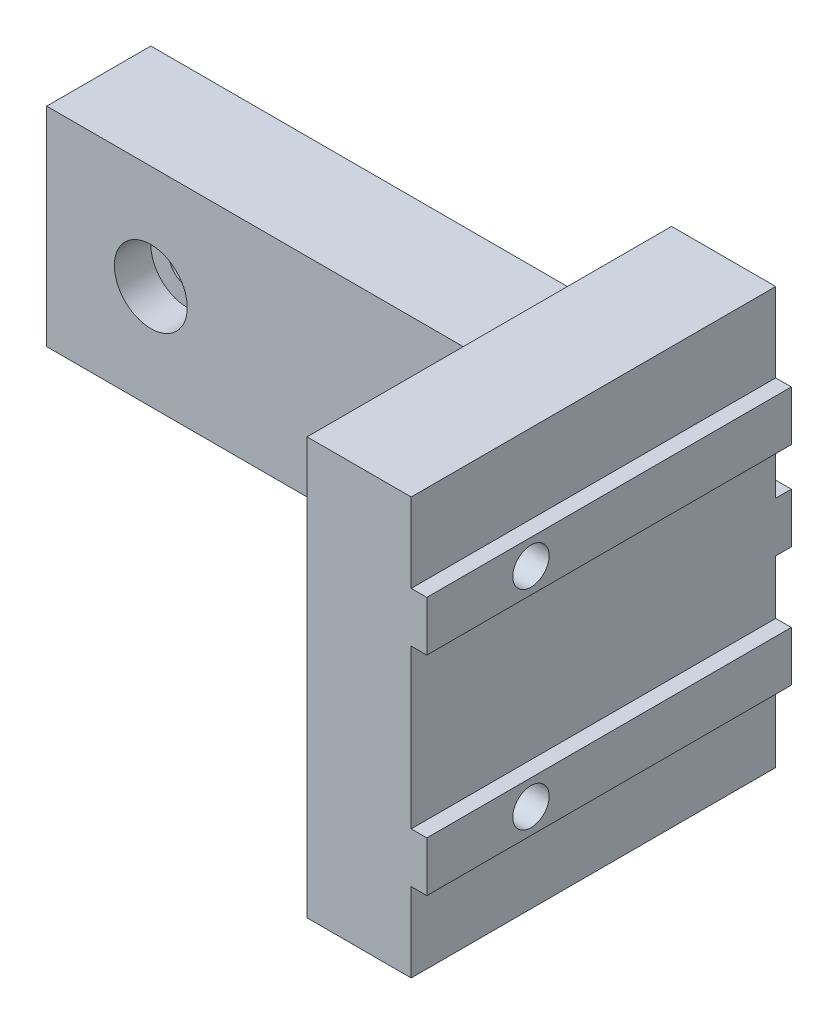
ISO-10303-21;
HEADER;
FILE_DESCRIPTION(('STEP AP214'),'2;1');
FILE_NAME('part.step','',(''),(''),'','','');
FILE_SCHEMA(('AUTOMOTIVE_DESIGN { 1 0 10303 214 1 1 1 1 }'));
ENDSEC;
DATA;
#1=APPLICATION_CONTEXT('core data for automotive mechanical design processes');
#2=APPLICATION_PROTOCOL_DEFINITION('international standard','automotive_design',2000,#1);
#3=PRODUCT_CONTEXT('',#1,'mechanical');
#4=PRODUCT('Part','Part','',(#3));
#5=PRODUCT_RELATED_PRODUCT_CATEGORY('part','',(#4));
#6=PRODUCT_DEFINITION_FORMATION('','',#4);
#7=PRODUCT_DEFINITION_CONTEXT('part definition',#1,'design');
#8=PRODUCT_DEFINITION('design','',#6,#7);
#9=PRODUCT_DEFINITION_SHAPE('','',#8);
#10=(LENGTH_UNIT() NAMED_UNIT(*) SI_UNIT(.MILLI.,.METRE.));
#11=(NAMED_UNIT(*) PLANE_ANGLE_UNIT() SI_UNIT($,.RADIAN.));
#12=(NAMED_UNIT(*) SI_UNIT($,.STERADIAN.) SOLID_ANGLE_UNIT());
#13=UNCERTAINTY_MEASURE_WITH_UNIT(LENGTH_MEASURE(1.E-05),#10,'distance_accuracy_value','');
#14=(GEOMETRIC_REPRESENTATION_CONTEXT(3) GLOBAL_UNCERTAINTY_ASSIGNED_CONTEXT((#13)) GLOBAL_UNIT_ASSIGNED_CONTEXT((#10,
#11,#12)) REPRESENTATION_CONTEXT('',''));
#15=CARTESIAN_POINT('',(0.,0.,0.));
#16=DIRECTION('',(0.,0.,1.));
#17=DIRECTION('',(1.,0.,0.));
#18=AXIS2_PLACEMENT_3D('',#15,#16,#17);
#19=CARTESIAN_POINT('',(0.,10.,0.));
#20=DIRECTION('',(-1.,0.,0.));
#21=DIRECTION('',(0.,0.,1.));
#22=AXIS2_PLACEMENT_3D('',#19,#20,#21);
#23=PLANE('',#22);
#24=DIRECTION('',(0.,0.,-1.));
#25=VECTOR('',#24,1.);
#26=CARTESIAN_POINT('',(0.,-12.4,35.));
#27=LINE('',#26,#25);
#28=CARTESIAN_POINT('',(0.,-12.4,35.));
#29=VERTEX_POINT('',#28);
#30=CARTESIAN_POINT('',(0.,-12.4,0.));
#31=VERTEX_POINT('',#30);
#32=EDGE_CURVE('E480',#29,#31,#27,.T.);
#33=ORIENTED_EDGE('',*,*,#32,.F.);
#34=DIRECTION('',(0.,-1.,0.));
#35=VECTOR('',#34,1.);
#36=CARTESIAN_POINT('',(0.,10.,35.));
#37=LINE('',#36,#35);
#38=CARTESIAN_POINT('',(0.,-20.,35.));
#39=VERTEX_POINT('',#38);
#40=EDGE_CURVE('E234',#29,#39,#37,.T.);
#41=ORIENTED_EDGE('',*,*,#40,.T.);
#42=DIRECTION('',(0.,0.,1.));
#43=VECTOR('',#42,1.);
#44=CARTESIAN_POINT('',(0.,-20.,-14.142135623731));
#45=LINE('',#44,#43);
#46=CARTESIAN_POINT('',(0.,-20.,0.));
#47=VERTEX_POINT('',#46);
#48=EDGE_CURVE('E283',#47,#39,#45,.T.);
#49=ORIENTED_EDGE('',*,*,#48,.F.);
#50=DIRECTION('',(0.,-1.,0.));
#51=VECTOR('',#50,1.);
#52=CARTESIAN_POINT('',(0.,10.,0.));
#53=LINE('',#52,#51);
#54=EDGE_CURVE('E374',#31,#47,#53,.T.);
#55=ORIENTED_EDGE('',*,*,#54,.F.);
#56=EDGE_LOOP('',(#33,#41,#49,#55));
#57=FACE_BOUND('',#56,.T.);
#58=ADVANCED_FACE('F47',(#57),#23,.F.);
#59=DIRECTION('',(0.,0.,1.));
#60=VECTOR('',#59,1.);
#61=CARTESIAN_POINT('',(0.,-7.60000000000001,35.));
#62=LINE('',#61,#60);
#63=CARTESIAN_POINT('',(0.,-7.59999999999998,0.));
#64=VERTEX_POINT('',#63);
#65=CARTESIAN_POINT('',(0.,-7.60000000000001,35.));
#66=VERTEX_POINT('',#65);
#67=EDGE_CURVE('E228',#64,#66,#62,.T.);
#68=ORIENTED_EDGE('',*,*,#67,.F.);
#69=CARTESIAN_POINT('',(0.,-2.4,0.));
#70=VERTEX_POINT('',#69);
#71=EDGE_CURVE('E379',#70,#64,#53,.T.);
#72=ORIENTED_EDGE('',*,*,#71,.F.);
#73=DIRECTION('',(0.,0.,-1.));
#74=VECTOR('',#73,1.);
#75=CARTESIAN_POINT('',(0.,-2.4,0.));
#76=LINE('',#75,#74);
#77=CARTESIAN_POINT('',(0.,-2.4,-1.5));
#78=VERTEX_POINT('',#77);
#79=EDGE_CURVE('E310',#70,#78,#76,.T.);
#80=ORIENTED_EDGE('',*,*,#79,.T.);
#81=DIRECTION('',(0.,-1.,0.));
#82=VECTOR('',#81,1.);
#83=CARTESIAN_POINT('',(0.,2.4,-1.5));
#84=LINE('',#83,#82);
#85=CARTESIAN_POINT('',(0.,2.4,-1.5));
#86=VERTEX_POINT('',#85);
#87=EDGE_CURVE('E343',#86,#78,#84,.T.);
#88=ORIENTED_EDGE('',*,*,#87,.F.);
#89=DIRECTION('',(0.,0.,-1.));
#90=VECTOR('',#89,1.);
#91=CARTESIAN_POINT('',(0.,2.4,0.));
#92=LINE('',#91,#90);
#93=CARTESIAN_POINT('',(0.,2.4,0.));
#94=VERTEX_POINT('',#93);
#95=EDGE_CURVE('E311',#94,#86,#92,.T.);
#96=ORIENTED_EDGE('',*,*,#95,.F.);
#97=CARTESIAN_POINT('',(0.,7.59999999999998,0.));
#98=VERTEX_POINT('',#97);
#99=EDGE_CURVE('E378',#98,#94,#53,.T.);
#100=ORIENTED_EDGE('',*,*,#99,.F.);
#101=DIRECTION('',(0.,0.,-1.));
#102=VECTOR('',#101,1.);
#103=CARTESIAN_POINT('',(0.,7.59999999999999,35.));
#104=LINE('',#103,#102);
#105=CARTESIAN_POINT('',(0.,7.59999999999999,35.));
#106=VERTEX_POINT('',#105);
#107=EDGE_CURVE('E236',#106,#98,#104,.T.);
#108=ORIENTED_EDGE('',*,*,#107,.F.);
#109=EDGE_CURVE('E384',#106,#66,#37,.T.);
#110=ORIENTED_EDGE('',*,*,#109,.T.);
#111=EDGE_LOOP('',(#68,#72,#80,#88,#96,#100,#108,#110));
#112=FACE_BOUND('',#111,.T.);
#113=ADVANCED_FACE('F503',(#112),#23,.F.);
#114=DIRECTION('',(0.,0.,1.));
#115=VECTOR('',#114,1.);
#116=CARTESIAN_POINT('',(0.,12.4,35.));
#117=LINE('',#116,#115);
#118=CARTESIAN_POINT('',(0.,12.4,0.));
#119=VERTEX_POINT('',#118);
#120=CARTESIAN_POINT('',(0.,12.4,35.));
#121=VERTEX_POINT('',#120);
#122=EDGE_CURVE('E77',#119,#121,#117,.T.);
#123=ORIENTED_EDGE('',*,*,#122,.F.);
#124=CARTESIAN_POINT('',(0.,20.,0.));
#125=VERTEX_POINT('',#124);
#126=EDGE_CURVE('E375',#125,#119,#53,.T.);
#127=ORIENTED_EDGE('',*,*,#126,.F.);
#128=DIRECTION('',(0.,0.,1.));
#129=VECTOR('',#128,1.);
#130=CARTESIAN_POINT('',(0.,20.,-14.142135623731));
#131=LINE('',#130,#129);
#132=CARTESIAN_POINT('',(0.,20.,35.));
#133=VERTEX_POINT('',#132);
#134=EDGE_CURVE('E297',#125,#133,#131,.T.);
#135=ORIENTED_EDGE('',*,*,#134,.T.);
#136=EDGE_CURVE('E380',#133,#121,#37,.T.);
#137=ORIENTED_EDGE('',*,*,#136,.T.);
#138=EDGE_LOOP('',(#123,#127,#135,#137));
#139=FACE_BOUND('',#138,.T.);
#140=ADVANCED_FACE('F646',(#139),#23,.F.);
#141=CARTESIAN_POINT('',(0.,-10.,0.));
#142=DIRECTION('',(0.,-1.,0.));
#143=DIRECTION('',(0.,0.,-1.));
#144=AXIS2_PLACEMENT_3D('',#141,#142,#143);
#145=PLANE('',#144);
#146=DIRECTION('',(-1.,0.,0.));
#147=VECTOR('',#146,1.);
#148=CARTESIAN_POINT('',(-60.,-10.,0.));
#149=LINE('',#148,#147);
#150=CARTESIAN_POINT('',(-20.0000000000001,-10.,0.));
#151=VERTEX_POINT('',#150);
#152=CARTESIAN_POINT('',(-60.,-10.,0.));
#153=VERTEX_POINT('',#152);
#154=EDGE_CURVE('E353',#151,#153,#149,.T.);
#155=ORIENTED_EDGE('',*,*,#154,.F.);
#156=DIRECTION('',(0.,0.,1.));
#157=VECTOR('',#156,1.);
#158=CARTESIAN_POINT('',(-20.0000000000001,-10.,0.));
#159=LINE('',#158,#157);
#160=CARTESIAN_POINT('',(-20.,-10.,10.));
#161=VERTEX_POINT('',#160);
#162=EDGE_CURVE('E398',#151,#161,#159,.T.);
#163=ORIENTED_EDGE('',*,*,#162,.T.);
#164=DIRECTION('',(1.,0.,0.));
#165=VECTOR('',#164,1.);
#166=CARTESIAN_POINT('',(-60.,-10.,10.));
#167=LINE('',#166,#165);
#168=CARTESIAN_POINT('',(-60.,-10.,10.));
#169=VERTEX_POINT('',#168);
#170=EDGE_CURVE('E364',#169,#161,#167,.T.);
#171=ORIENTED_EDGE('',*,*,#170,.F.);
#172=DIRECTION('',(0.,0.,1.));
#173=VECTOR('',#172,1.);
#174=CARTESIAN_POINT('',(-60.,-10.,10.));
#175=LINE('',#174,#173);
#176=EDGE_CURVE('E347',#153,#169,#175,.T.);
#177=ORIENTED_EDGE('',*,*,#176,.F.);
#178=EDGE_LOOP('',(#155,#163,#171,#177));
#179=FACE_BOUND('',#178,.T.);
#180=ADVANCED_FACE('F665',(#179),#145,.T.);
#181=CARTESIAN_POINT('',(0.,10.,0.));
#182=DIRECTION('',(0.,-1.,0.));
#183=DIRECTION('',(0.,0.,-1.));
#184=AXIS2_PLACEMENT_3D('',#181,#182,#183);
#185=PLANE('',#184);
#186=DIRECTION('',(1.,0.,0.));
#187=VECTOR('',#186,1.);
#188=CARTESIAN_POINT('',(-60.,10.,10.));
#189=LINE('',#188,#187);
#190=CARTESIAN_POINT('',(-60.,10.,10.));
#191=VERTEX_POINT('',#190);
#192=CARTESIAN_POINT('',(-20.,10.,10.));
#193=VERTEX_POINT('',#192);
#194=EDGE_CURVE('E352',#191,#193,#189,.T.);
#195=ORIENTED_EDGE('',*,*,#194,.T.);
#196=DIRECTION('',(0.,0.,-1.));
#197=VECTOR('',#196,1.);
#198=CARTESIAN_POINT('',(-20.,10.,0.));
#199=LINE('',#198,#197);
#200=CARTESIAN_POINT('',(-20.,10.,0.));
#201=VERTEX_POINT('',#200);
#202=EDGE_CURVE('E402',#193,#201,#199,.T.);
#203=ORIENTED_EDGE('',*,*,#202,.T.);
#204=DIRECTION('',(-1.,0.,0.));
#205=VECTOR('',#204,1.);
#206=CARTESIAN_POINT('',(-60.,10.,0.));
#207=LINE('',#206,#205);
#208=CARTESIAN_POINT('',(-60.,10.,0.));
#209=VERTEX_POINT('',#208);
#210=EDGE_CURVE('E357',#201,#209,#207,.T.);
#211=ORIENTED_EDGE('',*,*,#210,.T.);
#212=DIRECTION('',(0.,0.,1.));
#213=VECTOR('',#212,1.);
#214=CARTESIAN_POINT('',(-60.,10.,10.));
#215=LINE('',#214,#213);
#216=EDGE_CURVE('E348',#209,#191,#215,.T.);
#217=ORIENTED_EDGE('',*,*,#216,.T.);
#218=EDGE_LOOP('',(#195,#203,#211,#217));
#219=FACE_BOUND('',#218,.T.);
#220=ADVANCED_FACE('F656',(#219),#185,.F.);
#221=CARTESIAN_POINT('',(-60.,10.,0.));
#222=DIRECTION('',(0.,0.,1.));
#223=DIRECTION('',(1.,0.,0.));
#224=AXIS2_PLACEMENT_3D('',#221,#222,#223);
#225=PLANE('',#224);
#226=DIRECTION('',(1.,0.,0.));
#227=VECTOR('',#226,1.);
#228=CARTESIAN_POINT('',(0.,2.4,0.));
#229=LINE('',#228,#227);
#230=CARTESIAN_POINT('',(-60.,2.4,0.));
#231=VERTEX_POINT('',#230);
#232=EDGE_CURVE('E323',#231,#94,#229,.T.);
#233=ORIENTED_EDGE('',*,*,#232,.F.);
#234=DIRECTION('',(0.,-1.,0.));
#235=VECTOR('',#234,1.);
#236=CARTESIAN_POINT('',(-60.,10.,0.));
#237=LINE('',#236,#235);
#238=EDGE_CURVE('E370',#209,#231,#237,.T.);
#239=ORIENTED_EDGE('',*,*,#238,.F.);
#240=ORIENTED_EDGE('',*,*,#210,.F.);
#241=DIRECTION('',(-0.707106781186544,-0.707106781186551,0.));
#242=VECTOR('',#241,1.);
#243=CARTESIAN_POINT('',(-39.9999999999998,-10.,0.));
#244=LINE('',#243,#242);
#245=CARTESIAN_POINT('',(-9.99999999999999,20.,0.));
#246=VERTEX_POINT('',#245);
#247=EDGE_CURVE('E11',#201,#246,#244,.F.);
#248=ORIENTED_EDGE('',*,*,#247,.T.);
#249=DIRECTION('',(1.,0.,0.));
#250=VECTOR('',#249,1.);
#251=CARTESIAN_POINT('',(0.,20.,0.));
#252=LINE('',#251,#250);
#253=EDGE_CURVE('E302',#246,#125,#252,.T.);
#254=ORIENTED_EDGE('',*,*,#253,.T.);
#255=ORIENTED_EDGE('',*,*,#126,.T.);
#256=DIRECTION('',(-1.,0.,0.));
#257=VECTOR('',#256,1.);
#258=CARTESIAN_POINT('',(1.5,12.4,0.));
#259=LINE('',#258,#257);
#260=CARTESIAN_POINT('',(1.5,12.4,0.));
#261=VERTEX_POINT('',#260);
#262=EDGE_CURVE('E266',#261,#119,#259,.T.);
#263=ORIENTED_EDGE('',*,*,#262,.F.);
#264=DIRECTION('',(0.,1.,0.));
#265=VECTOR('',#264,1.);
#266=CARTESIAN_POINT('',(1.5,12.4,0.));
#267=LINE('',#266,#265);
#268=CARTESIAN_POINT('',(1.5,7.59999999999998,0.));
#269=VERTEX_POINT('',#268);
#270=EDGE_CURVE('E254',#269,#261,#267,.T.);
#271=ORIENTED_EDGE('',*,*,#270,.F.);
#272=DIRECTION('',(-1.,0.,0.));
#273=VECTOR('',#272,1.);
#274=CARTESIAN_POINT('',(1.5,7.59999999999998,0.));
#275=LINE('',#274,#273);
#276=EDGE_CURVE('E270',#269,#98,#275,.T.);
#277=ORIENTED_EDGE('',*,*,#276,.T.);
#278=ORIENTED_EDGE('',*,*,#99,.T.);
#279=EDGE_LOOP('',(#233,#239,#240,#248,#254,#255,#263,#271,#277,#278));
#280=FACE_BOUND('',#279,.T.);
#281=ADVANCED_FACE('F686',(#280),#225,.F.);
#282=CARTESIAN_POINT('',(-60.,10.,10.));
#283=DIRECTION('',(1.,0.,0.));
#284=DIRECTION('',(0.,0.,-1.));
#285=AXIS2_PLACEMENT_3D('',#282,#283,#284);
#286=PLANE('',#285);
#287=ORIENTED_EDGE('',*,*,#176,.T.);
#288=DIRECTION('',(0.,-1.,0.));
#289=VECTOR('',#288,1.);
#290=CARTESIAN_POINT('',(-60.,10.,10.));
#291=LINE('',#290,#289);
#292=EDGE_CURVE('E394',#191,#169,#291,.T.);
#293=ORIENTED_EDGE('',*,*,#292,.F.);
#294=ORIENTED_EDGE('',*,*,#216,.F.);
#295=ORIENTED_EDGE('',*,*,#238,.T.);
#296=DIRECTION('',(0.,0.,1.));
#297=VECTOR('',#296,1.);
#298=CARTESIAN_POINT('',(-60.,2.4,0.));
#299=LINE('',#298,#297);
#300=CARTESIAN_POINT('',(-60.,2.4,-1.5));
#301=VERTEX_POINT('',#300);
#302=EDGE_CURVE('E319',#301,#231,#299,.T.);
#303=ORIENTED_EDGE('',*,*,#302,.F.);
#304=DIRECTION('',(0.,-1.,0.));
#305=VECTOR('',#304,1.);
#306=CARTESIAN_POINT('',(-60.,2.4,-1.5));
#307=LINE('',#306,#305);
#308=CARTESIAN_POINT('',(-60.,-2.4,-1.5));
#309=VERTEX_POINT('',#308);
#310=EDGE_CURVE('E327',#301,#309,#307,.T.);
#311=ORIENTED_EDGE('',*,*,#310,.T.);
#312=DIRECTION('',(0.,0.,1.));
#313=VECTOR('',#312,1.);
#314=CARTESIAN_POINT('',(-60.,-2.4,0.));
#315=LINE('',#314,#313);
#316=CARTESIAN_POINT('',(-60.,-2.4,0.));
#317=VERTEX_POINT('',#316);
#318=EDGE_CURVE('E334',#309,#317,#315,.T.);
#319=ORIENTED_EDGE('',*,*,#318,.T.);
#320=EDGE_CURVE('E360',#317,#153,#237,.T.);
#321=ORIENTED_EDGE('',*,*,#320,.T.);
#322=EDGE_LOOP('',(#287,#293,#294,#295,#303,#311,#319,#321));
#323=FACE_BOUND('',#322,.T.);
#324=ADVANCED_FACE('F671',(#323),#286,.F.);
#325=CARTESIAN_POINT('',(-60.,10.,10.));
#326=DIRECTION('',(0.,0.,-1.));
#327=DIRECTION('',(-1.,0.,0.));
#328=AXIS2_PLACEMENT_3D('',#325,#326,#327);
#329=PLANE('',#328);
#330=CARTESIAN_POINT('',(-25.,0.,10.));
#331=DIRECTION('',(0.,0.,-1.));
#332=DIRECTION('',(-1.,0.,0.));
#333=AXIS2_PLACEMENT_3D('',#330,#331,#332);
#334=CIRCLE('',#333,3.5);
#335=CARTESIAN_POINT('',(-28.5,0.,10.));
#336=VERTEX_POINT('',#335);
#337=EDGE_CURVE('E52',#336,#336,#334,.T.);
#338=ORIENTED_EDGE('',*,*,#337,.T.);
#339=EDGE_LOOP('',(#338));
#340=FACE_BOUND('',#339,.T.);
#341=CARTESIAN_POINT('',(-50.,0.,10.));
#342=DIRECTION('',(0.,0.,-1.));
#343=DIRECTION('',(-1.,0.,0.));
#344=AXIS2_PLACEMENT_3D('',#341,#342,#343);
#345=CIRCLE('',#344,3.5);
#346=CARTESIAN_POINT('',(-53.5,0.,10.));
#347=VERTEX_POINT('',#346);
#348=EDGE_CURVE('E440',#347,#347,#345,.T.);
#349=ORIENTED_EDGE('',*,*,#348,.T.);
#350=EDGE_LOOP('',(#349));
#351=FACE_BOUND('',#350,.T.);
#352=ORIENTED_EDGE('',*,*,#170,.T.);
#353=DIRECTION('',(0.,-1.,0.));
#354=VECTOR('',#353,1.);
#355=CARTESIAN_POINT('',(-20.,10.,10.));
#356=LINE('',#355,#354);
#357=EDGE_CURVE('E390',#193,#161,#356,.T.);
#358=ORIENTED_EDGE('',*,*,#357,.F.);
#359=ORIENTED_EDGE('',*,*,#194,.F.);
#360=ORIENTED_EDGE('',*,*,#292,.T.);
#361=EDGE_LOOP('',(#352,#358,#359,#360));
#362=FACE_BOUND('',#361,.T.);
#363=ADVANCED_FACE('F661',(#340,#351,#362),#329,.F.);
#364=CARTESIAN_POINT('',(-20.,10.,10.));
#365=DIRECTION('',(0.707106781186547,0.,-0.707106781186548));
#366=DIRECTION('',(-0.707106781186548,0.,-0.707106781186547));
#367=AXIS2_PLACEMENT_3D('',#364,#365,#366);
#368=PLANE('',#367);
#369=ORIENTED_EDGE('',*,*,#357,.T.);
#370=DIRECTION('',(0.577350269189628,-0.577350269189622,0.577350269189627));
#371=VECTOR('',#370,1.);
#372=CARTESIAN_POINT('',(-26.6666666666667,-3.33333333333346,3.33333333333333));
#373=LINE('',#372,#371);
#374=CARTESIAN_POINT('',(-9.99999999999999,-20.,20.));
#375=VERTEX_POINT('',#374);
#376=EDGE_CURVE('E405',#161,#375,#373,.T.);
#377=ORIENTED_EDGE('',*,*,#376,.T.);
#378=DIRECTION('',(0.,-1.,0.));
#379=VECTOR('',#378,1.);
#380=CARTESIAN_POINT('',(-9.99999999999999,10.,20.));
#381=LINE('',#380,#379);
#382=CARTESIAN_POINT('',(-9.99999999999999,20.,20.));
#383=VERTEX_POINT('',#382);
#384=EDGE_CURVE('E387',#383,#375,#381,.T.);
#385=ORIENTED_EDGE('',*,*,#384,.F.);
#386=DIRECTION('',(0.577350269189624,0.57735026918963,0.577350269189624));
#387=VECTOR('',#386,1.);
#388=CARTESIAN_POINT('',(-20.,10.,10.));
#389=LINE('',#388,#387);
#390=EDGE_CURVE('E58',#383,#193,#389,.F.);
#391=ORIENTED_EDGE('',*,*,#390,.T.);
#392=EDGE_LOOP('',(#369,#377,#385,#391));
#393=FACE_BOUND('',#392,.T.);
#394=ADVANCED_FACE('F653',(#393),#368,.F.);
#395=CARTESIAN_POINT('',(-9.99999999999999,10.,20.));
#396=DIRECTION('',(1.,0.,0.));
#397=DIRECTION('',(0.,0.,-1.));
#398=AXIS2_PLACEMENT_3D('',#395,#396,#397);
#399=PLANE('',#398);
#400=CARTESIAN_POINT('',(-9.99999999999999,9.99999999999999,25.));
#401=DIRECTION('',(1.,0.,0.));
#402=DIRECTION('',(0.,0.,-1.));
#403=AXIS2_PLACEMENT_3D('',#400,#401,#402);
#404=CIRCLE('',#403,3.5);
#405=CARTESIAN_POINT('',(-9.99999999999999,9.99999999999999,21.5));
#406=VERTEX_POINT('',#405);
#407=EDGE_CURVE('E427',#406,#406,#404,.T.);
#408=ORIENTED_EDGE('',*,*,#407,.T.);
#409=EDGE_LOOP('',(#408));
#410=FACE_BOUND('',#409,.T.);
#411=CARTESIAN_POINT('',(-9.99999999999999,-10.,25.));
#412=DIRECTION('',(1.,0.,0.));
#413=DIRECTION('',(0.,0.,-1.));
#414=AXIS2_PLACEMENT_3D('',#411,#412,#413);
#415=CIRCLE('',#414,3.5);
#416=CARTESIAN_POINT('',(-9.99999999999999,-10.,21.5));
#417=VERTEX_POINT('',#416);
#418=EDGE_CURVE('E423',#417,#417,#415,.T.);
#419=ORIENTED_EDGE('',*,*,#418,.T.);
#420=EDGE_LOOP('',(#419));
#421=FACE_BOUND('',#420,.T.);
#422=ORIENTED_EDGE('',*,*,#384,.T.);
#423=DIRECTION('',(0.,0.,1.));
#424=VECTOR('',#423,1.);
#425=CARTESIAN_POINT('',(-9.99999999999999,-20.,-14.142135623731));
#426=LINE('',#425,#424);
#427=CARTESIAN_POINT('',(-9.99999999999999,-20.,35.));
#428=VERTEX_POINT('',#427);
#429=EDGE_CURVE('E286',#375,#428,#426,.T.);
#430=ORIENTED_EDGE('',*,*,#429,.T.);
#431=DIRECTION('',(0.,-1.,0.));
#432=VECTOR('',#431,1.);
#433=CARTESIAN_POINT('',(-10.,10.,35.));
#434=LINE('',#433,#432);
#435=CARTESIAN_POINT('',(-9.99999999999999,20.,35.));
#436=VERTEX_POINT('',#435);
#437=EDGE_CURVE('E383',#436,#428,#434,.T.);
#438=ORIENTED_EDGE('',*,*,#437,.F.);
#439=DIRECTION('',(0.,0.,1.));
#440=VECTOR('',#439,1.);
#441=CARTESIAN_POINT('',(-9.99999999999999,20.,-14.142135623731));
#442=LINE('',#441,#440);
#443=EDGE_CURVE('E303',#383,#436,#442,.T.);
#444=ORIENTED_EDGE('',*,*,#443,.F.);
#445=EDGE_LOOP('',(#422,#430,#438,#444));
#446=FACE_BOUND('',#445,.T.);
#447=ADVANCED_FACE('F643',(#410,#421,#446),#399,.F.);
#448=CARTESIAN_POINT('',(0.,10.,35.));
#449=DIRECTION('',(0.,0.,-1.));
#450=DIRECTION('',(-1.,0.,0.));
#451=AXIS2_PLACEMENT_3D('',#448,#449,#450);
#452=PLANE('',#451);
#453=ORIENTED_EDGE('',*,*,#437,.T.);
#454=DIRECTION('',(1.,0.,0.));
#455=VECTOR('',#454,1.);
#456=CARTESIAN_POINT('',(0.,-20.,35.));
#457=LINE('',#456,#455);
#458=EDGE_CURVE('E278',#428,#39,#457,.T.);
#459=ORIENTED_EDGE('',*,*,#458,.T.);
#460=ORIENTED_EDGE('',*,*,#40,.F.);
#461=DIRECTION('',(-1.,0.,0.));
#462=VECTOR('',#461,1.);
#463=CARTESIAN_POINT('',(1.5,-12.4,35.));
#464=LINE('',#463,#462);
#465=CARTESIAN_POINT('',(1.5,-12.4,35.));
#466=VERTEX_POINT('',#465);
#467=EDGE_CURVE('E213',#466,#29,#464,.T.);
#468=ORIENTED_EDGE('',*,*,#467,.F.);
#469=DIRECTION('',(0.,-1.,0.));
#470=VECTOR('',#469,1.);
#471=CARTESIAN_POINT('',(1.5,-7.60000000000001,35.));
#472=LINE('',#471,#470);
#473=CARTESIAN_POINT('',(1.5,-7.60000000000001,35.));
#474=VERTEX_POINT('',#473);
#475=EDGE_CURVE('E218',#474,#466,#472,.T.);
#476=ORIENTED_EDGE('',*,*,#475,.F.);
#477=DIRECTION('',(-1.,0.,0.));
#478=VECTOR('',#477,1.);
#479=CARTESIAN_POINT('',(1.5,-7.60000000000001,35.));
#480=LINE('',#479,#478);
#481=EDGE_CURVE('E486',#474,#66,#480,.T.);
#482=ORIENTED_EDGE('',*,*,#481,.T.);
#483=ORIENTED_EDGE('',*,*,#109,.F.);
#484=DIRECTION('',(-1.,0.,0.));
#485=VECTOR('',#484,1.);
#486=CARTESIAN_POINT('',(1.5,7.59999999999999,35.));
#487=LINE('',#486,#485);
#488=CARTESIAN_POINT('',(1.5,7.59999999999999,35.));
#489=VERTEX_POINT('',#488);
#490=EDGE_CURVE('E274',#489,#106,#487,.T.);
#491=ORIENTED_EDGE('',*,*,#490,.F.);
#492=DIRECTION('',(0.,-1.,0.));
#493=VECTOR('',#492,1.);
#494=CARTESIAN_POINT('',(1.5,12.4,35.));
#495=LINE('',#494,#493);
#496=CARTESIAN_POINT('',(1.5,12.4,35.));
#497=VERTEX_POINT('',#496);
#498=EDGE_CURVE('E247',#497,#489,#495,.T.);
#499=ORIENTED_EDGE('',*,*,#498,.F.);
#500=DIRECTION('',(-1.,0.,0.));
#501=VECTOR('',#500,1.);
#502=CARTESIAN_POINT('',(1.5,12.4,35.));
#503=LINE('',#502,#501);
#504=EDGE_CURVE('E259',#497,#121,#503,.T.);
#505=ORIENTED_EDGE('',*,*,#504,.T.);
#506=ORIENTED_EDGE('',*,*,#136,.F.);
#507=DIRECTION('',(-1.,0.,0.));
#508=VECTOR('',#507,1.);
#509=CARTESIAN_POINT('',(0.,20.,35.));
#510=LINE('',#509,#508);
#511=EDGE_CURVE('E282',#133,#436,#510,.T.);
#512=ORIENTED_EDGE('',*,*,#511,.T.);
#513=EDGE_LOOP('',(#453,#459,#460,#468,#476,#482,#483,#491,#499,#505,#506,#512));
#514=FACE_BOUND('',#513,.T.);
#515=ADVANCED_FACE('F232',(#514),#452,.F.);
#516=ORIENTED_EDGE('',*,*,#320,.F.);
#517=DIRECTION('',(1.,0.,0.));
#518=VECTOR('',#517,1.);
#519=CARTESIAN_POINT('',(0.,-2.4,0.));
#520=LINE('',#519,#518);
#521=EDGE_CURVE('E316',#317,#70,#520,.T.);
#522=ORIENTED_EDGE('',*,*,#521,.T.);
#523=ORIENTED_EDGE('',*,*,#71,.T.);
#524=DIRECTION('',(-1.,0.,0.));
#525=VECTOR('',#524,1.);
#526=CARTESIAN_POINT('',(1.5,-7.59999999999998,0.));
#527=LINE('',#526,#525);
#528=CARTESIAN_POINT('',(1.5,-7.59999999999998,0.));
#529=VERTEX_POINT('',#528);
#530=EDGE_CURVE('E243',#529,#64,#527,.T.);
#531=ORIENTED_EDGE('',*,*,#530,.F.);
#532=DIRECTION('',(0.,1.,0.));
#533=VECTOR('',#532,1.);
#534=CARTESIAN_POINT('',(1.5,-7.59999999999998,0.));
#535=LINE('',#534,#533);
#536=CARTESIAN_POINT('',(1.5,-12.4,0.));
#537=VERTEX_POINT('',#536);
#538=EDGE_CURVE('E217',#537,#529,#535,.T.);
#539=ORIENTED_EDGE('',*,*,#538,.F.);
#540=DIRECTION('',(-1.,0.,0.));
#541=VECTOR('',#540,1.);
#542=CARTESIAN_POINT('',(1.5,-12.4,0.));
#543=LINE('',#542,#541);
#544=EDGE_CURVE('E69',#537,#31,#543,.T.);
#545=ORIENTED_EDGE('',*,*,#544,.T.);
#546=ORIENTED_EDGE('',*,*,#54,.T.);
#547=DIRECTION('',(-1.,0.,0.));
#548=VECTOR('',#547,1.);
#549=CARTESIAN_POINT('',(0.,-20.,0.));
#550=LINE('',#549,#548);
#551=CARTESIAN_POINT('',(-9.99999999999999,-20.,0.));
#552=VERTEX_POINT('',#551);
#553=EDGE_CURVE('E279',#47,#552,#550,.T.);
#554=ORIENTED_EDGE('',*,*,#553,.T.);
#555=DIRECTION('',(-0.707106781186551,0.707106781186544,0.));
#556=VECTOR('',#555,1.);
#557=CARTESIAN_POINT('',(-50.0000000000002,19.9999999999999,0.));
#558=LINE('',#557,#556);
#559=EDGE_CURVE('E409',#552,#151,#558,.T.);
#560=ORIENTED_EDGE('',*,*,#559,.T.);
#561=ORIENTED_EDGE('',*,*,#154,.T.);
#562=EDGE_LOOP('',(#516,#522,#523,#531,#539,#545,#546,#554,#560,#561));
#563=FACE_BOUND('',#562,.T.);
#564=ADVANCED_FACE('F506',(#563),#225,.F.);
#565=CARTESIAN_POINT('',(-60.,2.4,-1.5));
#566=DIRECTION('',(0.,0.,1.));
#567=DIRECTION('',(1.,0.,0.));
#568=AXIS2_PLACEMENT_3D('',#565,#566,#567);
#569=PLANE('',#568);
#570=CARTESIAN_POINT('',(-50.,0.,-1.5));
#571=DIRECTION('',(0.,0.,-1.));
#572=DIRECTION('',(-1.,0.,0.));
#573=AXIS2_PLACEMENT_3D('',#570,#571,#572);
#574=CIRCLE('',#573,1.74999999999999);
#575=CARTESIAN_POINT('',(-51.75,0.,-1.5));
#576=VERTEX_POINT('',#575);
#577=EDGE_CURVE('E431',#576,#576,#574,.T.);
#578=ORIENTED_EDGE('',*,*,#577,.F.);
#579=EDGE_LOOP('',(#578));
#580=FACE_BOUND('',#579,.T.);
#581=CARTESIAN_POINT('',(-25.,0.,-1.5));
#582=DIRECTION('',(0.,0.,-1.));
#583=DIRECTION('',(-1.,0.,0.));
#584=AXIS2_PLACEMENT_3D('',#581,#582,#583);
#585=CIRCLE('',#584,1.74999999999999);
#586=CARTESIAN_POINT('',(-26.75,0.,-1.5));
#587=VERTEX_POINT('',#586);
#588=EDGE_CURVE('E469',#587,#587,#585,.T.);
#589=ORIENTED_EDGE('',*,*,#588,.F.);
#590=EDGE_LOOP('',(#589));
#591=FACE_BOUND('',#590,.T.);
#592=DIRECTION('',(-1.,0.,0.));
#593=VECTOR('',#592,1.);
#594=CARTESIAN_POINT('',(-60.,-2.4,-1.5));
#595=LINE('',#594,#593);
#596=EDGE_CURVE('E331',#78,#309,#595,.T.);
#597=ORIENTED_EDGE('',*,*,#596,.T.);
#598=ORIENTED_EDGE('',*,*,#310,.F.);
#599=DIRECTION('',(-1.,0.,0.));
#600=VECTOR('',#599,1.);
#601=CARTESIAN_POINT('',(-60.,2.4,-1.5));
#602=LINE('',#601,#600);
#603=EDGE_CURVE('E315',#86,#301,#602,.T.);
#604=ORIENTED_EDGE('',*,*,#603,.F.);
#605=ORIENTED_EDGE('',*,*,#87,.T.);
#606=EDGE_LOOP('',(#597,#598,#604,#605));
#607=FACE_BOUND('',#606,.T.);
#608=ADVANCED_FACE('F682',(#580,#591,#607),#569,.F.);
#609=CARTESIAN_POINT('',(0.,2.4,0.));
#610=DIRECTION('',(0.,-1.,0.));
#611=DIRECTION('',(0.,0.,-1.));
#612=AXIS2_PLACEMENT_3D('',#609,#610,#611);
#613=PLANE('',#612);
#614=ORIENTED_EDGE('',*,*,#95,.T.);
#615=ORIENTED_EDGE('',*,*,#603,.T.);
#616=ORIENTED_EDGE('',*,*,#302,.T.);
#617=ORIENTED_EDGE('',*,*,#232,.T.);
#618=EDGE_LOOP('',(#614,#615,#616,#617));
#619=FACE_BOUND('',#618,.T.);
#620=ADVANCED_FACE('F684',(#619),#613,.F.);
#621=CARTESIAN_POINT('',(0.,-2.4,0.));
#622=DIRECTION('',(0.,-1.,0.));
#623=DIRECTION('',(0.,0.,-1.));
#624=AXIS2_PLACEMENT_3D('',#621,#622,#623);
#625=PLANE('',#624);
#626=ORIENTED_EDGE('',*,*,#79,.F.);
#627=ORIENTED_EDGE('',*,*,#521,.F.);
#628=ORIENTED_EDGE('',*,*,#318,.F.);
#629=ORIENTED_EDGE('',*,*,#596,.F.);
#630=EDGE_LOOP('',(#626,#627,#628,#629));
#631=FACE_BOUND('',#630,.T.);
#632=ADVANCED_FACE('F678',(#631),#625,.T.);
#633=CARTESIAN_POINT('',(0.,20.,-14.142135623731));
#634=DIRECTION('',(0.,1.,0.));
#635=DIRECTION('',(0.,0.,1.));
#636=AXIS2_PLACEMENT_3D('',#633,#634,#635);
#637=PLANE('',#636);
#638=ORIENTED_EDGE('',*,*,#253,.F.);
#639=EDGE_CURVE('E298',#246,#383,#442,.T.);
#640=ORIENTED_EDGE('',*,*,#639,.T.);
#641=ORIENTED_EDGE('',*,*,#443,.T.);
#642=ORIENTED_EDGE('',*,*,#511,.F.);
#643=ORIENTED_EDGE('',*,*,#134,.F.);
#644=EDGE_LOOP('',(#638,#640,#641,#642,#643));
#645=FACE_BOUND('',#644,.T.);
#646=ADVANCED_FACE('F639',(#645),#637,.T.);
#647=CARTESIAN_POINT('',(0.,-20.,-14.142135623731));
#648=DIRECTION('',(0.,-1.,0.));
#649=DIRECTION('',(0.,0.,-1.));
#650=AXIS2_PLACEMENT_3D('',#647,#648,#649);
#651=PLANE('',#650);
#652=ORIENTED_EDGE('',*,*,#553,.F.);
#653=ORIENTED_EDGE('',*,*,#48,.T.);
#654=ORIENTED_EDGE('',*,*,#458,.F.);
#655=ORIENTED_EDGE('',*,*,#429,.F.);
#656=EDGE_CURVE('E290',#552,#375,#426,.T.);
#657=ORIENTED_EDGE('',*,*,#656,.F.);
#658=EDGE_LOOP('',(#652,#653,#654,#655,#657));
#659=FACE_BOUND('',#658,.T.);
#660=ADVANCED_FACE('F521',(#659),#651,.T.);
#661=CARTESIAN_POINT('',(-20.0000000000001,-10.,0.));
#662=DIRECTION('',(0.707106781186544,0.707106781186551,0.));
#663=DIRECTION('',(0.,0.,1.));
#664=AXIS2_PLACEMENT_3D('',#661,#662,#663);
#665=PLANE('',#664);
#666=ORIENTED_EDGE('',*,*,#559,.F.);
#667=ORIENTED_EDGE('',*,*,#656,.T.);
#668=ORIENTED_EDGE('',*,*,#376,.F.);
#669=ORIENTED_EDGE('',*,*,#162,.F.);
#670=EDGE_LOOP('',(#666,#667,#668,#669));
#671=FACE_BOUND('',#670,.T.);
#672=ADVANCED_FACE('F668',(#671),#665,.F.);
#673=CARTESIAN_POINT('',(-9.99999999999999,20.0000000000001,20.));
#674=DIRECTION('',(-0.707106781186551,0.707106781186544,0.));
#675=DIRECTION('',(0.,0.,-1.));
#676=AXIS2_PLACEMENT_3D('',#673,#674,#675);
#677=PLANE('',#676);
#678=ORIENTED_EDGE('',*,*,#247,.F.);
#679=ORIENTED_EDGE('',*,*,#202,.F.);
#680=ORIENTED_EDGE('',*,*,#390,.F.);
#681=ORIENTED_EDGE('',*,*,#639,.F.);
#682=EDGE_LOOP('',(#678,#679,#680,#681));
#683=FACE_BOUND('',#682,.T.);
#684=ADVANCED_FACE('F50',(#683),#677,.T.);
#685=CARTESIAN_POINT('',(1.5,7.59999999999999,35.));
#686=DIRECTION('',(0.,1.,0.));
#687=DIRECTION('',(0.,0.,1.));
#688=AXIS2_PLACEMENT_3D('',#685,#686,#687);
#689=PLANE('',#688);
#690=ORIENTED_EDGE('',*,*,#107,.T.);
#691=ORIENTED_EDGE('',*,*,#276,.F.);
#692=DIRECTION('',(0.,0.,-1.));
#693=VECTOR('',#692,1.);
#694=CARTESIAN_POINT('',(1.5,7.59999999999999,35.));
#695=LINE('',#694,#693);
#696=EDGE_CURVE('E251',#489,#269,#695,.T.);
#697=ORIENTED_EDGE('',*,*,#696,.F.);
#698=ORIENTED_EDGE('',*,*,#490,.T.);
#699=EDGE_LOOP('',(#690,#691,#697,#698));
#700=FACE_BOUND('',#699,.T.);
#701=ADVANCED_FACE('F690',(#700),#689,.F.);
#702=CARTESIAN_POINT('',(1.5,12.4,35.));
#703=DIRECTION('',(0.,-1.,0.));
#704=DIRECTION('',(0.,0.,-1.));
#705=AXIS2_PLACEMENT_3D('',#702,#703,#704);
#706=PLANE('',#705);
#707=ORIENTED_EDGE('',*,*,#122,.T.);
#708=ORIENTED_EDGE('',*,*,#504,.F.);
#709=DIRECTION('',(0.,0.,1.));
#710=VECTOR('',#709,1.);
#711=CARTESIAN_POINT('',(1.5,12.4,35.));
#712=LINE('',#711,#710);
#713=EDGE_CURVE('E257',#261,#497,#712,.T.);
#714=ORIENTED_EDGE('',*,*,#713,.F.);
#715=ORIENTED_EDGE('',*,*,#262,.T.);
#716=EDGE_LOOP('',(#707,#708,#714,#715));
#717=FACE_BOUND('',#716,.T.);
#718=ADVANCED_FACE('F697',(#717),#706,.F.);
#719=CARTESIAN_POINT('',(1.5,0.,0.));
#720=DIRECTION('',(1.,0.,0.));
#721=DIRECTION('',(0.,0.,-1.));
#722=AXIS2_PLACEMENT_3D('',#719,#720,#721);
#723=PLANE('',#722);
#724=CARTESIAN_POINT('',(1.5,9.99999999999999,25.));
#725=DIRECTION('',(1.,0.,0.));
#726=DIRECTION('',(0.,0.,-1.));
#727=AXIS2_PLACEMENT_3D('',#724,#725,#726);
#728=CIRCLE('',#727,1.75);
#729=CARTESIAN_POINT('',(1.5,9.99999999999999,23.25));
#730=VERTEX_POINT('',#729);
#731=EDGE_CURVE('E473',#730,#730,#728,.T.);
#732=ORIENTED_EDGE('',*,*,#731,.F.);
#733=EDGE_LOOP('',(#732));
#734=FACE_BOUND('',#733,.T.);
#735=ORIENTED_EDGE('',*,*,#498,.T.);
#736=ORIENTED_EDGE('',*,*,#696,.T.);
#737=ORIENTED_EDGE('',*,*,#270,.T.);
#738=ORIENTED_EDGE('',*,*,#713,.T.);
#739=EDGE_LOOP('',(#735,#736,#737,#738));
#740=FACE_BOUND('',#739,.T.);
#741=ADVANCED_FACE('F693',(#734,#740),#723,.T.);
#742=CARTESIAN_POINT('',(1.5,-12.4,35.));
#743=DIRECTION('',(0.,1.,0.));
#744=DIRECTION('',(0.,0.,1.));
#745=AXIS2_PLACEMENT_3D('',#742,#743,#744);
#746=PLANE('',#745);
#747=ORIENTED_EDGE('',*,*,#32,.T.);
#748=ORIENTED_EDGE('',*,*,#544,.F.);
#749=DIRECTION('',(0.,0.,-1.));
#750=VECTOR('',#749,1.);
#751=CARTESIAN_POINT('',(1.5,-12.4,35.));
#752=LINE('',#751,#750);
#753=EDGE_CURVE('E209',#466,#537,#752,.T.);
#754=ORIENTED_EDGE('',*,*,#753,.F.);
#755=ORIENTED_EDGE('',*,*,#467,.T.);
#756=EDGE_LOOP('',(#747,#748,#754,#755));
#757=FACE_BOUND('',#756,.T.);
#758=ADVANCED_FACE('F211',(#757),#746,.F.);
#759=CARTESIAN_POINT('',(1.5,-7.60000000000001,35.));
#760=DIRECTION('',(0.,-1.,0.));
#761=DIRECTION('',(0.,0.,-1.));
#762=AXIS2_PLACEMENT_3D('',#759,#760,#761);
#763=PLANE('',#762);
#764=ORIENTED_EDGE('',*,*,#67,.T.);
#765=ORIENTED_EDGE('',*,*,#481,.F.);
#766=DIRECTION('',(0.,0.,1.));
#767=VECTOR('',#766,1.);
#768=CARTESIAN_POINT('',(1.5,-7.60000000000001,35.));
#769=LINE('',#768,#767);
#770=EDGE_CURVE('E223',#529,#474,#769,.T.);
#771=ORIENTED_EDGE('',*,*,#770,.F.);
#772=ORIENTED_EDGE('',*,*,#530,.T.);
#773=EDGE_LOOP('',(#764,#765,#771,#772));
#774=FACE_BOUND('',#773,.T.);
#775=ADVANCED_FACE('F498',(#774),#763,.F.);
#776=CARTESIAN_POINT('',(1.5,0.,0.));
#777=DIRECTION('',(1.,0.,0.));
#778=DIRECTION('',(0.,0.,-1.));
#779=AXIS2_PLACEMENT_3D('',#776,#777,#778);
#780=PLANE('',#779);
#781=CARTESIAN_POINT('',(1.5,-10.,25.));
#782=DIRECTION('',(1.,0.,0.));
#783=DIRECTION('',(0.,0.,-1.));
#784=AXIS2_PLACEMENT_3D('',#781,#782,#783);
#785=CIRCLE('',#784,1.75);
#786=CARTESIAN_POINT('',(1.5,-10.,23.25));
#787=VERTEX_POINT('',#786);
#788=EDGE_CURVE('E477',#787,#787,#785,.T.);
#789=ORIENTED_EDGE('',*,*,#788,.F.);
#790=EDGE_LOOP('',(#789));
#791=FACE_BOUND('',#790,.T.);
#792=ORIENTED_EDGE('',*,*,#475,.T.);
#793=ORIENTED_EDGE('',*,*,#753,.T.);
#794=ORIENTED_EDGE('',*,*,#538,.T.);
#795=ORIENTED_EDGE('',*,*,#770,.T.);
#796=EDGE_LOOP('',(#792,#793,#794,#795));
#797=FACE_BOUND('',#796,.T.);
#798=ADVANCED_FACE('F221',(#791,#797),#780,.T.);
#799=CARTESIAN_POINT('',(1.5,-10.,25.));
#800=DIRECTION('',(1.,0.,0.));
#801=DIRECTION('',(0.,0.,-1.));
#802=AXIS2_PLACEMENT_3D('',#799,#800,#801);
#803=CYLINDRICAL_SURFACE('',#802,1.74999999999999);
#804=CARTESIAN_POINT('',(-6.5,-10.,25.));
#805=DIRECTION('',(1.,0.,0.));
#806=DIRECTION('',(0.,0.,-1.));
#807=AXIS2_PLACEMENT_3D('',#804,#805,#806);
#808=CIRCLE('',#807,1.74999999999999);
#809=CARTESIAN_POINT('',(-6.5,-10.,23.25));
#810=VERTEX_POINT('',#809);
#811=EDGE_CURVE('E418',#810,#810,#808,.F.);
#812=ORIENTED_EDGE('',*,*,#811,.T.);
#813=EDGE_LOOP('',(#812));
#814=FACE_BOUND('',#813,.T.);
#815=ORIENTED_EDGE('',*,*,#788,.T.);
#816=EDGE_LOOP('',(#815));
#817=FACE_BOUND('',#816,.T.);
#818=ADVANCED_FACE('F822',(#814,#817),#803,.F.);
#819=CARTESIAN_POINT('',(1.5,9.99999999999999,25.));
#820=DIRECTION('',(1.,0.,0.));
#821=DIRECTION('',(0.,0.,-1.));
#822=AXIS2_PLACEMENT_3D('',#819,#820,#821);
#823=CYLINDRICAL_SURFACE('',#822,1.74999999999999);
#824=CARTESIAN_POINT('',(-6.5,9.99999999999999,25.));
#825=DIRECTION('',(1.,0.,0.));
#826=DIRECTION('',(0.,0.,-1.));
#827=AXIS2_PLACEMENT_3D('',#824,#825,#826);
#828=CIRCLE('',#827,1.74999999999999);
#829=CARTESIAN_POINT('',(-6.5,9.99999999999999,23.25));
#830=VERTEX_POINT('',#829);
#831=EDGE_CURVE('E414',#830,#830,#828,.F.);
#832=ORIENTED_EDGE('',*,*,#831,.T.);
#833=EDGE_LOOP('',(#832));
#834=FACE_BOUND('',#833,.T.);
#835=ORIENTED_EDGE('',*,*,#731,.T.);
#836=EDGE_LOOP('',(#835));
#837=FACE_BOUND('',#836,.T.);
#838=ADVANCED_FACE('F833',(#834,#837),#823,.F.);
#839=CARTESIAN_POINT('',(-25.,0.,-1.5));
#840=DIRECTION('',(0.,0.,-1.));
#841=DIRECTION('',(-1.,0.,0.));
#842=AXIS2_PLACEMENT_3D('',#839,#840,#841);
#843=CYLINDRICAL_SURFACE('',#842,1.74999999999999);
#844=CARTESIAN_POINT('',(-25.,0.,6.5));
#845=DIRECTION('',(0.,0.,-1.));
#846=DIRECTION('',(-1.,0.,0.));
#847=AXIS2_PLACEMENT_3D('',#844,#845,#846);
#848=CIRCLE('',#847,1.74999999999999);
#849=CARTESIAN_POINT('',(-26.75,0.,6.5));
#850=VERTEX_POINT('',#849);
#851=EDGE_CURVE('E436',#850,#850,#848,.F.);
#852=ORIENTED_EDGE('',*,*,#851,.T.);
#853=EDGE_LOOP('',(#852));
#854=FACE_BOUND('',#853,.T.);
#855=ORIENTED_EDGE('',*,*,#588,.T.);
#856=EDGE_LOOP('',(#855));
#857=FACE_BOUND('',#856,.T.);
#858=ADVANCED_FACE('F844',(#854,#857),#843,.F.);
#859=CARTESIAN_POINT('',(-50.,0.,-1.5));
#860=DIRECTION('',(0.,0.,-1.));
#861=DIRECTION('',(-1.,0.,0.));
#862=AXIS2_PLACEMENT_3D('',#859,#860,#861);
#863=CYLINDRICAL_SURFACE('',#862,1.74999999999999);
#864=CARTESIAN_POINT('',(-50.,0.,6.5));
#865=DIRECTION('',(0.,0.,-1.));
#866=DIRECTION('',(-1.,0.,0.));
#867=AXIS2_PLACEMENT_3D('',#864,#865,#866);
#868=CIRCLE('',#867,1.74999999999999);
#869=CARTESIAN_POINT('',(-51.75,0.,6.5));
#870=VERTEX_POINT('',#869);
#871=EDGE_CURVE('E432',#870,#870,#868,.F.);
#872=ORIENTED_EDGE('',*,*,#871,.T.);
#873=EDGE_LOOP('',(#872));
#874=FACE_BOUND('',#873,.T.);
#875=ORIENTED_EDGE('',*,*,#577,.T.);
#876=EDGE_LOOP('',(#875));
#877=FACE_BOUND('',#876,.T.);
#878=ADVANCED_FACE('F855',(#874,#877),#863,.F.);
#879=CARTESIAN_POINT('',(-60.,9.99999999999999,25.));
#880=DIRECTION('',(1.,0.,0.));
#881=DIRECTION('',(0.,0.,-1.));
#882=AXIS2_PLACEMENT_3D('',#879,#880,#881);
#883=CYLINDRICAL_SURFACE('',#882,3.5);
#884=CARTESIAN_POINT('',(-6.5,9.99999999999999,25.));
#885=DIRECTION('',(1.,0.,0.));
#886=DIRECTION('',(0.,0.,-1.));
#887=AXIS2_PLACEMENT_3D('',#884,#885,#886);
#888=CIRCLE('',#887,3.5);
#889=CARTESIAN_POINT('',(-6.5,9.99999999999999,21.5));
#890=VERTEX_POINT('',#889);
#891=EDGE_CURVE('E419',#890,#890,#888,.T.);
#892=ORIENTED_EDGE('',*,*,#891,.T.);
#893=EDGE_LOOP('',(#892));
#894=FACE_BOUND('',#893,.T.);
#895=ORIENTED_EDGE('',*,*,#407,.F.);
#896=EDGE_LOOP('',(#895));
#897=FACE_BOUND('',#896,.T.);
#898=ADVANCED_FACE('F866',(#894,#897),#883,.F.);
#899=CARTESIAN_POINT('',(-6.5,9.99999999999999,25.));
#900=DIRECTION('',(1.,0.,0.));
#901=DIRECTION('',(0.,0.,-1.));
#902=AXIS2_PLACEMENT_3D('',#899,#900,#901);
#903=PLANE('',#902);
#904=ORIENTED_EDGE('',*,*,#891,.F.);
#905=EDGE_LOOP('',(#904));
#906=FACE_BOUND('',#905,.T.);
#907=ORIENTED_EDGE('',*,*,#831,.F.);
#908=EDGE_LOOP('',(#907));
#909=FACE_BOUND('',#908,.T.);
#910=ADVANCED_FACE('F877',(#906,#909),#903,.F.);
#911=CARTESIAN_POINT('',(-60.,-10.,25.));
#912=DIRECTION('',(1.,0.,0.));
#913=DIRECTION('',(0.,0.,-1.));
#914=AXIS2_PLACEMENT_3D('',#911,#912,#913);
#915=CYLINDRICAL_SURFACE('',#914,3.5);
#916=CARTESIAN_POINT('',(-6.5,-10.,25.));
#917=DIRECTION('',(1.,0.,0.));
#918=DIRECTION('',(0.,0.,-1.));
#919=AXIS2_PLACEMENT_3D('',#916,#917,#918);
#920=CIRCLE('',#919,3.5);
#921=CARTESIAN_POINT('',(-6.5,-10.,21.5));
#922=VERTEX_POINT('',#921);
#923=EDGE_CURVE('E449',#922,#922,#920,.T.);
#924=ORIENTED_EDGE('',*,*,#923,.T.);
#925=EDGE_LOOP('',(#924));
#926=FACE_BOUND('',#925,.T.);
#927=ORIENTED_EDGE('',*,*,#418,.F.);
#928=EDGE_LOOP('',(#927));
#929=FACE_BOUND('',#928,.T.);
#930=ADVANCED_FACE('F886',(#926,#929),#915,.F.);
#931=CARTESIAN_POINT('',(-6.5,-10.,25.));
#932=DIRECTION('',(1.,0.,0.));
#933=DIRECTION('',(0.,0.,-1.));
#934=AXIS2_PLACEMENT_3D('',#931,#932,#933);
#935=PLANE('',#934);
#936=ORIENTED_EDGE('',*,*,#923,.F.);
#937=EDGE_LOOP('',(#936));
#938=FACE_BOUND('',#937,.T.);
#939=ORIENTED_EDGE('',*,*,#811,.F.);
#940=EDGE_LOOP('',(#939));
#941=FACE_BOUND('',#940,.T.);
#942=ADVANCED_FACE('F897',(#938,#941),#935,.F.);
#943=CARTESIAN_POINT('',(-50.,0.,35.));
#944=DIRECTION('',(0.,0.,-1.));
#945=DIRECTION('',(-1.,0.,0.));
#946=AXIS2_PLACEMENT_3D('',#943,#944,#945);
#947=CYLINDRICAL_SURFACE('',#946,3.5);
#948=CARTESIAN_POINT('',(-50.,0.,6.5));
#949=DIRECTION('',(0.,0.,-1.));
#950=DIRECTION('',(-1.,0.,0.));
#951=AXIS2_PLACEMENT_3D('',#948,#949,#950);
#952=CIRCLE('',#951,3.5);
#953=CARTESIAN_POINT('',(-53.5,0.,6.5));
#954=VERTEX_POINT('',#953);
#955=EDGE_CURVE('E602',#954,#954,#952,.T.);
#956=ORIENTED_EDGE('',*,*,#955,.T.);
#957=EDGE_LOOP('',(#956));
#958=FACE_BOUND('',#957,.T.);
#959=ORIENTED_EDGE('',*,*,#348,.F.);
#960=EDGE_LOOP('',(#959));
#961=FACE_BOUND('',#960,.T.);
#962=ADVANCED_FACE('F906',(#958,#961),#947,.F.);
#963=CARTESIAN_POINT('',(-50.,0.,6.5));
#964=DIRECTION('',(0.,0.,-1.));
#965=DIRECTION('',(-1.,0.,0.));
#966=AXIS2_PLACEMENT_3D('',#963,#964,#965);
#967=PLANE('',#966);
#968=ORIENTED_EDGE('',*,*,#955,.F.);
#969=EDGE_LOOP('',(#968));
#970=FACE_BOUND('',#969,.T.);
#971=ORIENTED_EDGE('',*,*,#871,.F.);
#972=EDGE_LOOP('',(#971));
#973=FACE_BOUND('',#972,.T.);
#974=ADVANCED_FACE('F915',(#970,#973),#967,.F.);
#975=CARTESIAN_POINT('',(-25.,0.,35.));
#976=DIRECTION('',(0.,0.,-1.));
#977=DIRECTION('',(-1.,0.,0.));
#978=AXIS2_PLACEMENT_3D('',#975,#976,#977);
#979=CYLINDRICAL_SURFACE('',#978,3.5);
#980=CARTESIAN_POINT('',(-25.,0.,6.5));
#981=DIRECTION('',(0.,0.,-1.));
#982=DIRECTION('',(-1.,0.,0.));
#983=AXIS2_PLACEMENT_3D('',#980,#981,#982);
#984=CIRCLE('',#983,3.5);
#985=CARTESIAN_POINT('',(-28.5,0.,6.5));
#986=VERTEX_POINT('',#985);
#987=EDGE_CURVE('E437',#986,#986,#984,.T.);
#988=ORIENTED_EDGE('',*,*,#987,.T.);
#989=EDGE_LOOP('',(#988));
#990=FACE_BOUND('',#989,.T.);
#991=ORIENTED_EDGE('',*,*,#337,.F.);
#992=EDGE_LOOP('',(#991));
#993=FACE_BOUND('',#992,.T.);
#994=ADVANCED_FACE('F925',(#990,#993),#979,.F.);
#995=CARTESIAN_POINT('',(-25.,0.,6.5));
#996=DIRECTION('',(0.,0.,-1.));
#997=DIRECTION('',(-1.,0.,0.));
#998=AXIS2_PLACEMENT_3D('',#995,#996,#997);
#999=PLANE('',#998);
#1000=ORIENTED_EDGE('',*,*,#987,.F.);
#1001=EDGE_LOOP('',(#1000));
#1002=FACE_BOUND('',#1001,.T.);
#1003=ORIENTED_EDGE('',*,*,#851,.F.);
#1004=EDGE_LOOP('',(#1003));
#1005=FACE_BOUND('',#1004,.T.);
#1006=ADVANCED_FACE('F935',(#1002,#1005),#999,.F.);
#1007=CLOSED_SHELL('',(#58,#113,#140,#180,#220,#281,#324,#363,#394,#447,#515,#564,#608,#620,
#632,#646,#660,#672,#684,#701,#718,#741,#758,#775,#798,#818,#838,#858,#878,#898,#910,#930,#942,
#962,#974,#994,#1006));
#1008=MANIFOLD_SOLID_BREP('B2',#1007);
#1009=ADVANCED_BREP_SHAPE_REPRESENTATION('',(#18,#1008),#14);
#1010=SHAPE_DEFINITION_REPRESENTATION(#9,#1009);
ENDSEC;
END-ISO-10303-21;
